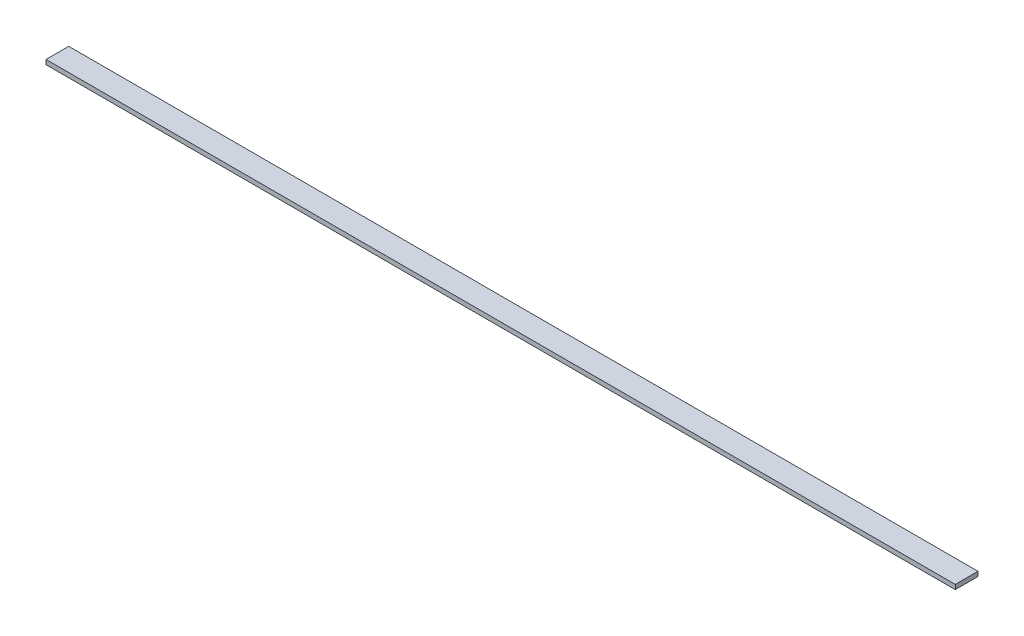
ISO-10303-21;
HEADER;
FILE_DESCRIPTION(('STEP AP214'),'2;1');
FILE_NAME('part.step','',(''),(''),'','','');
FILE_SCHEMA(('AUTOMOTIVE_DESIGN { 1 0 10303 214 1 1 1 1 }'));
ENDSEC;
DATA;
#1=APPLICATION_CONTEXT('core data for automotive mechanical design processes');
#2=APPLICATION_PROTOCOL_DEFINITION('international standard','automotive_design',2000,#1);
#3=PRODUCT_CONTEXT('',#1,'mechanical');
#4=PRODUCT('Part','Part','',(#3));
#5=PRODUCT_RELATED_PRODUCT_CATEGORY('part','',(#4));
#6=PRODUCT_DEFINITION_FORMATION('','',#4);
#7=PRODUCT_DEFINITION_CONTEXT('part definition',#1,'design');
#8=PRODUCT_DEFINITION('design','',#6,#7);
#9=PRODUCT_DEFINITION_SHAPE('','',#8);
#10=(LENGTH_UNIT() NAMED_UNIT(*) SI_UNIT(.MILLI.,.METRE.));
#11=(NAMED_UNIT(*) PLANE_ANGLE_UNIT() SI_UNIT($,.RADIAN.));
#12=(NAMED_UNIT(*) SI_UNIT($,.STERADIAN.) SOLID_ANGLE_UNIT());
#13=UNCERTAINTY_MEASURE_WITH_UNIT(LENGTH_MEASURE(1.E-05),#10,'distance_accuracy_value','');
#14=(GEOMETRIC_REPRESENTATION_CONTEXT(3) GLOBAL_UNCERTAINTY_ASSIGNED_CONTEXT((#13)) GLOBAL_UNIT_ASSIGNED_CONTEXT((#10,
#11,#12)) REPRESENTATION_CONTEXT('',''));
#15=CARTESIAN_POINT('',(0.,0.,0.));
#16=DIRECTION('',(0.,0.,1.));
#17=DIRECTION('',(1.,0.,0.));
#18=AXIS2_PLACEMENT_3D('',#15,#16,#17);
#19=CARTESIAN_POINT('',(0.,0.,250.));
#20=DIRECTION('',(1.,0.,0.));
#21=DIRECTION('',(0.,0.,-1.));
#22=AXIS2_PLACEMENT_3D('',#19,#20,#21);
#23=PLANE('',#22);
#24=DIRECTION('',(0.,-1.,0.));
#25=VECTOR('',#24,1.);
#26=CARTESIAN_POINT('',(0.,0.,-250.));
#27=LINE('',#26,#25);
#28=CARTESIAN_POINT('',(0.,100.,-250.));
#29=VERTEX_POINT('',#28);
#30=CARTESIAN_POINT('',(0.,0.,-250.));
#31=VERTEX_POINT('',#30);
#32=EDGE_CURVE('E102',#29,#31,#27,.T.);
#33=ORIENTED_EDGE('',*,*,#32,.T.);
#34=DIRECTION('',(0.,0.,-1.));
#35=VECTOR('',#34,1.);
#36=CARTESIAN_POINT('',(0.,0.,250.));
#37=LINE('',#36,#35);
#38=CARTESIAN_POINT('',(0.,0.,250.));
#39=VERTEX_POINT('',#38);
#40=EDGE_CURVE('E11',#39,#31,#37,.T.);
#41=ORIENTED_EDGE('',*,*,#40,.F.);
#42=DIRECTION('',(0.,-1.,0.));
#43=VECTOR('',#42,1.);
#44=CARTESIAN_POINT('',(0.,0.,250.));
#45=LINE('',#44,#43);
#46=CARTESIAN_POINT('',(0.,100.,250.));
#47=VERTEX_POINT('',#46);
#48=EDGE_CURVE('E90',#47,#39,#45,.T.);
#49=ORIENTED_EDGE('',*,*,#48,.F.);
#50=DIRECTION('',(0.,0.,-1.));
#51=VECTOR('',#50,1.);
#52=CARTESIAN_POINT('',(0.,100.,250.));
#53=LINE('',#52,#51);
#54=EDGE_CURVE('E98',#47,#29,#53,.T.);
#55=ORIENTED_EDGE('',*,*,#54,.T.);
#56=EDGE_LOOP('',(#33,#41,#49,#55));
#57=FACE_BOUND('',#56,.T.);
#58=ADVANCED_FACE('F39',(#57),#23,.F.);
#59=CARTESIAN_POINT('',(0.,0.,250.));
#60=DIRECTION('',(0.,1.,0.));
#61=DIRECTION('',(0.,0.,1.));
#62=AXIS2_PLACEMENT_3D('',#59,#60,#61);
#63=PLANE('',#62);
#64=DIRECTION('',(1.,0.,0.));
#65=VECTOR('',#64,1.);
#66=CARTESIAN_POINT('',(0.,0.,-250.));
#67=LINE('',#66,#65);
#68=CARTESIAN_POINT('',(20000.,0.,-250.));
#69=VERTEX_POINT('',#68);
#70=EDGE_CURVE('E94',#31,#69,#67,.T.);
#71=ORIENTED_EDGE('',*,*,#70,.T.);
#72=DIRECTION('',(0.,0.,-1.));
#73=VECTOR('',#72,1.);
#74=CARTESIAN_POINT('',(20000.,0.,250.));
#75=LINE('',#74,#73);
#76=CARTESIAN_POINT('',(20000.,0.,250.));
#77=VERTEX_POINT('',#76);
#78=EDGE_CURVE('E47',#77,#69,#75,.T.);
#79=ORIENTED_EDGE('',*,*,#78,.F.);
#80=DIRECTION('',(1.,0.,0.));
#81=VECTOR('',#80,1.);
#82=CARTESIAN_POINT('',(0.,0.,250.));
#83=LINE('',#82,#81);
#84=EDGE_CURVE('E85',#39,#77,#83,.T.);
#85=ORIENTED_EDGE('',*,*,#84,.F.);
#86=ORIENTED_EDGE('',*,*,#40,.T.);
#87=EDGE_LOOP('',(#71,#79,#85,#86));
#88=FACE_BOUND('',#87,.T.);
#89=ADVANCED_FACE('F93',(#88),#63,.F.);
#90=CARTESIAN_POINT('',(20000.,0.,250.));
#91=DIRECTION('',(-1.,0.,0.));
#92=DIRECTION('',(0.,0.,1.));
#93=AXIS2_PLACEMENT_3D('',#90,#91,#92);
#94=PLANE('',#93);
#95=DIRECTION('',(0.,1.,0.));
#96=VECTOR('',#95,1.);
#97=CARTESIAN_POINT('',(20000.,0.,-250.));
#98=LINE('',#97,#96);
#99=CARTESIAN_POINT('',(20000.,99.9999999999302,-250.));
#100=VERTEX_POINT('',#99);
#101=EDGE_CURVE('E72',#69,#100,#98,.T.);
#102=ORIENTED_EDGE('',*,*,#101,.T.);
#103=DIRECTION('',(0.,0.,-1.));
#104=VECTOR('',#103,1.);
#105=CARTESIAN_POINT('',(20000.,99.9999999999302,250.));
#106=LINE('',#105,#104);
#107=CARTESIAN_POINT('',(20000.,99.9999999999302,250.));
#108=VERTEX_POINT('',#107);
#109=EDGE_CURVE('E95',#108,#100,#106,.T.);
#110=ORIENTED_EDGE('',*,*,#109,.F.);
#111=DIRECTION('',(0.,1.,0.));
#112=VECTOR('',#111,1.);
#113=CARTESIAN_POINT('',(20000.,0.,250.));
#114=LINE('',#113,#112);
#115=EDGE_CURVE('E88',#77,#108,#114,.T.);
#116=ORIENTED_EDGE('',*,*,#115,.F.);
#117=ORIENTED_EDGE('',*,*,#78,.T.);
#118=EDGE_LOOP('',(#102,#110,#116,#117));
#119=FACE_BOUND('',#118,.T.);
#120=ADVANCED_FACE('F96',(#119),#94,.F.);
#121=CARTESIAN_POINT('',(0.,100.,250.));
#122=DIRECTION('',(0.,-1.,0.));
#123=DIRECTION('',(1.,0.,0.));
#124=AXIS2_PLACEMENT_3D('',#121,#122,#123);
#125=PLANE('',#124);
#126=DIRECTION('',(-1.,0.,0.));
#127=VECTOR('',#126,1.);
#128=CARTESIAN_POINT('',(0.,100.,-250.));
#129=LINE('',#128,#127);
#130=EDGE_CURVE('E78',#100,#29,#129,.T.);
#131=ORIENTED_EDGE('',*,*,#130,.T.);
#132=ORIENTED_EDGE('',*,*,#54,.F.);
#133=DIRECTION('',(-1.,0.,0.));
#134=VECTOR('',#133,1.);
#135=CARTESIAN_POINT('',(0.,100.,250.));
#136=LINE('',#135,#134);
#137=EDGE_CURVE('E55',#108,#47,#136,.T.);
#138=ORIENTED_EDGE('',*,*,#137,.F.);
#139=ORIENTED_EDGE('',*,*,#109,.T.);
#140=EDGE_LOOP('',(#131,#132,#138,#139));
#141=FACE_BOUND('',#140,.T.);
#142=ADVANCED_FACE('F109',(#141),#125,.F.);
#143=CARTESIAN_POINT('',(0.,100.,250.));
#144=DIRECTION('',(0.,0.,-1.));
#145=DIRECTION('',(-1.,0.,0.));
#146=AXIS2_PLACEMENT_3D('',#143,#144,#145);
#147=PLANE('',#146);
#148=ORIENTED_EDGE('',*,*,#48,.T.);
#149=ORIENTED_EDGE('',*,*,#84,.T.);
#150=ORIENTED_EDGE('',*,*,#115,.T.);
#151=ORIENTED_EDGE('',*,*,#137,.T.);
#152=EDGE_LOOP('',(#148,#149,#150,#151));
#153=FACE_BOUND('',#152,.T.);
#154=ADVANCED_FACE('F86',(#153),#147,.F.);
#155=CARTESIAN_POINT('',(0.,100.,-250.));
#156=DIRECTION('',(0.,0.,-1.));
#157=DIRECTION('',(-1.,0.,0.));
#158=AXIS2_PLACEMENT_3D('',#155,#156,#157);
#159=PLANE('',#158);
#160=ORIENTED_EDGE('',*,*,#32,.F.);
#161=ORIENTED_EDGE('',*,*,#130,.F.);
#162=ORIENTED_EDGE('',*,*,#101,.F.);
#163=ORIENTED_EDGE('',*,*,#70,.F.);
#164=EDGE_LOOP('',(#160,#161,#162,#163));
#165=FACE_BOUND('',#164,.T.);
#166=ADVANCED_FACE('F112',(#165),#159,.T.);
#167=CLOSED_SHELL('',(#58,#89,#120,#142,#154,#166));
#168=MANIFOLD_SOLID_BREP('B2',#167);
#169=ADVANCED_BREP_SHAPE_REPRESENTATION('',(#18,#168),#14);
#170=SHAPE_DEFINITION_REPRESENTATION(#9,#169);
ENDSEC;
END-ISO-10303-21;
